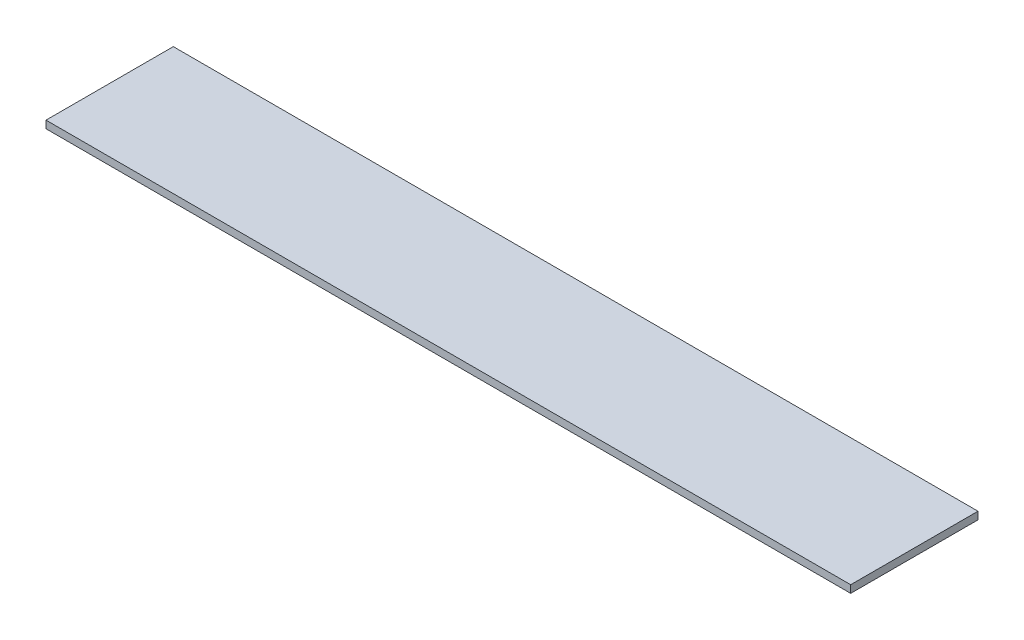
from build123d import *

# Parameters (mm, degrees)
SKETCH1_W           = 170.18
SKETCH1_H           = 24.384
BOSS_EXTRUDE1_DEPTH = 26.924
SKETCH2_W           = 170.18
SKETCH2_H           = 25.3365
CUT_EXTRUDE1_DEPTH  = 12.7
SKETCH3_W           = 170.18
SKETCH3_H           = 10.0965
CUT_EXTRUDE3_DEPTH  = 25.3365
SKETCH5_R           = 2.032
CUT_EXTRUDE5_DEPTH  = 2.54
SKETCH6_W           = 478.508276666
SKETCH6_H           = 84.503527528
CUT_EXTRUDE6_DEPTH  = 2.54


with BuildPart() as part:
    # Sketch1 → Boss-Extrude1 (new body)
    with BuildSketch(Plane.XY):
        with Locations((-124.736086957, 55.646509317)):
            Rectangle(SKETCH1_W, SKETCH1_H)
    extrude(amount=BOSS_EXTRUDE1_DEPTH)

    # Sketch2 → Cut-Extrude1 (cut)
    with BuildSketch(Plane(origin=(0, 67.838509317, 0), x_dir=(1, 0, 0), z_dir=(0, 1, 0))):
        with Locations((-124.736086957, -14.25575)):
            Rectangle(SKETCH2_W, SKETCH2_H)
    extrude(amount=-CUT_EXTRUDE1_DEPTH, mode=Mode.SUBTRACT)

    # Sketch3 → Cut-Extrude3 (cut)
    with BuildSketch(Plane.XY.offset(26.924)):
        with Locations((-124.736086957, 50.090259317)):
            Rectangle(SKETCH3_W, SKETCH3_H)
    extrude(amount=-CUT_EXTRUDE3_DEPTH, mode=Mode.SUBTRACT)

    # Sketch5 → Cut-Extrude5 (cut)
    with BuildSketch(Plane(origin=(0, 0, 0), x_dir=(-1, 0, 0), z_dir=(0, 0, -1))):
        with Locations((52.346086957, 55.138509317)):
            Circle(SKETCH5_R)
        with Locations((-39.093913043, 55.138509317)):
            Circle(SKETCH5_R)
    extrude(amount=-CUT_EXTRUDE5_DEPTH, mode=Mode.SUBTRACT)

    # Sketch6 → Cut-Extrude6 (cut)
    with BuildSketch(Plane.XY.offset(1.5875)):
        with Locations((29.428051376, 87.293773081)):
            Rectangle(SKETCH6_W, SKETCH6_H)
    extrude(amount=-CUT_EXTRUDE6_DEPTH, mode=Mode.SUBTRACT)


solid = part.part
